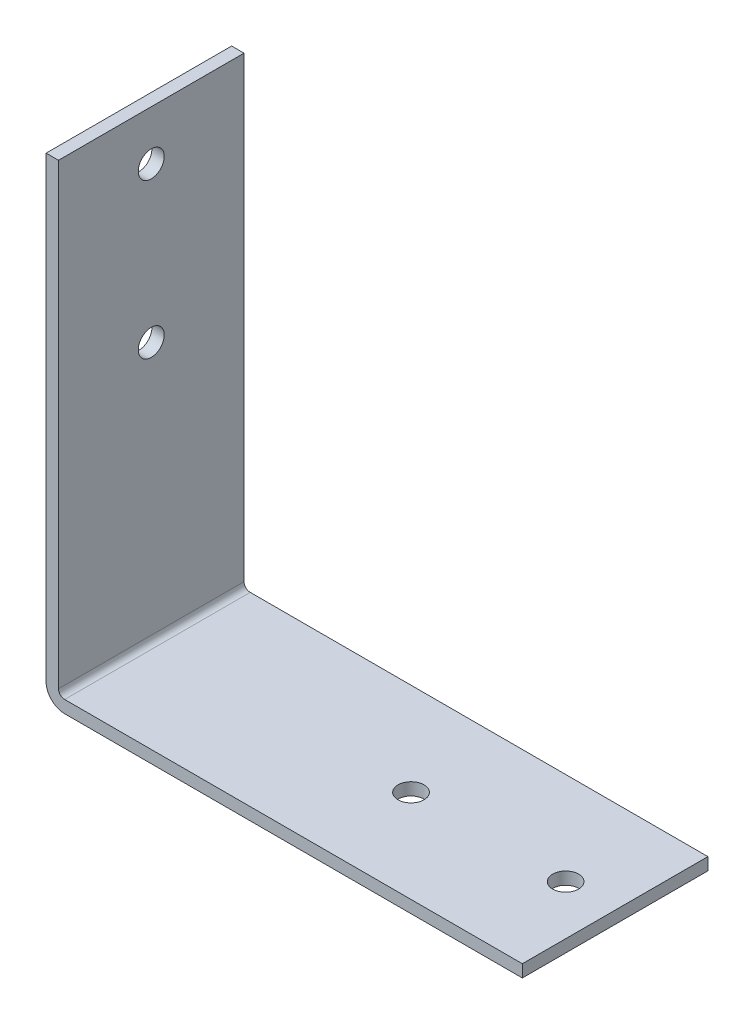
from build123d import *

# Parameters (mm, degrees)
BOSS_EXTRUDE1_DEPTH      = 15
BOSS_EXTRUDE1_DEPTH_BACK = 15
SKETCH2_R                = 2.1
CUT_EXTRUDE1_DEPTH       = 109.531101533
SKETCH3_R                = 2.1
CUT_EXTRUDE2_DEPTH       = 109.531101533
FILLET1_R                = 1
FILLET2_R                = 3


with BuildPart() as part:
    # Sketch1 → Boss-Extrude1 (new, two sides: drawn at the far end of the back side and taken through both)
    with BuildSketch(Plane.XY.offset(-BOSS_EXTRUDE1_DEPTH_BACK)):
        Polygon((0, 77), (0, 0), (77, 0), (77, 2), (2, 2), (2, 77), align=None)
    extrude(amount=BOSS_EXTRUDE1_DEPTH + BOSS_EXTRUDE1_DEPTH_BACK)

    # Sketch2 → Cut-Extrude1 (cut, through all)
    with BuildSketch(Plane(origin=(0, 2, 0), x_dir=(1, 0, 0), z_dir=(0, 1, 0))):
        with Locations(Location((69, 0, 0), (0, 0, 180))):
            Circle(SKETCH2_R)
        with Locations(Location((44, 0, 0), (0, 0, 180))):
            Circle(SKETCH2_R)
    extrude(amount=-CUT_EXTRUDE1_DEPTH, mode=Mode.SUBTRACT)

    # Sketch3 → Cut-Extrude2 (cut, through all)
    with BuildSketch(Plane(origin=(2, 0, 0), x_dir=(0, 0, -1), z_dir=(1, 0, 0))):
        with Locations((0, 69)):
            Circle(SKETCH3_R)
        with Locations((0, 44)):
            Circle(SKETCH3_R)
    extrude(amount=-CUT_EXTRUDE2_DEPTH, mode=Mode.SUBTRACT)

    # Fillet1
    fillet1_edges = [part.edges().sort_by_distance(p)[0] for p in [
        (2, 2, 0),
    ]]
    fillet(fillet1_edges, radius=FILLET1_R)

    # Fillet2
    fillet2_edges = [part.edges().sort_by_distance(p)[0] for p in [
        (0, 0, 0),
    ]]
    fillet(fillet2_edges, radius=FILLET2_R)


solid = part.part
